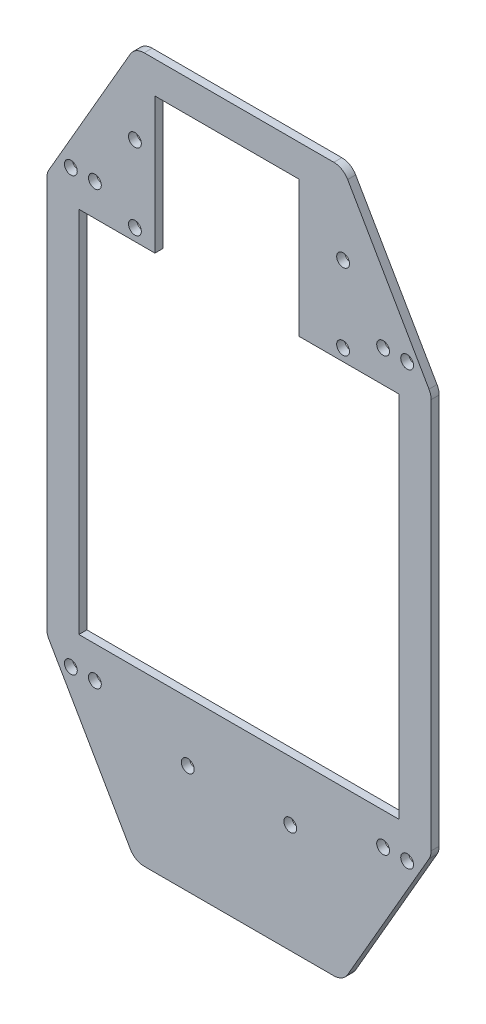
ISO-10303-21;
HEADER;
FILE_DESCRIPTION(('STEP AP214'),'2;1');
FILE_NAME('part.step','',(''),(''),'','','');
FILE_SCHEMA(('AUTOMOTIVE_DESIGN { 1 0 10303 214 1 1 1 1 }'));
ENDSEC;
DATA;
#1=APPLICATION_CONTEXT('core data for automotive mechanical design processes');
#2=APPLICATION_PROTOCOL_DEFINITION('international standard','automotive_design',2000,#1);
#3=PRODUCT_CONTEXT('',#1,'mechanical');
#4=PRODUCT('Part','Part','',(#3));
#5=PRODUCT_RELATED_PRODUCT_CATEGORY('part','',(#4));
#6=PRODUCT_DEFINITION_FORMATION('','',#4);
#7=PRODUCT_DEFINITION_CONTEXT('part definition',#1,'design');
#8=PRODUCT_DEFINITION('design','',#6,#7);
#9=PRODUCT_DEFINITION_SHAPE('','',#8);
#10=(LENGTH_UNIT() NAMED_UNIT(*) SI_UNIT(.MILLI.,.METRE.));
#11=(NAMED_UNIT(*) PLANE_ANGLE_UNIT() SI_UNIT($,.RADIAN.));
#12=(NAMED_UNIT(*) SI_UNIT($,.STERADIAN.) SOLID_ANGLE_UNIT());
#13=UNCERTAINTY_MEASURE_WITH_UNIT(LENGTH_MEASURE(1.E-05),#10,'distance_accuracy_value','');
#14=(GEOMETRIC_REPRESENTATION_CONTEXT(3) GLOBAL_UNCERTAINTY_ASSIGNED_CONTEXT((#13)) GLOBAL_UNIT_ASSIGNED_CONTEXT((#10,
#11,#12)) REPRESENTATION_CONTEXT('',''));
#15=CARTESIAN_POINT('',(0.,0.,0.));
#16=DIRECTION('',(0.,0.,1.));
#17=DIRECTION('',(1.,0.,0.));
#18=AXIS2_PLACEMENT_3D('',#15,#16,#17);
#19=CARTESIAN_POINT('',(0.,0.,4.));
#20=DIRECTION('',(0.,0.,1.));
#21=DIRECTION('',(1.,0.,0.));
#22=AXIS2_PLACEMENT_3D('',#19,#20,#21);
#23=PLANE('',#22);
#24=CARTESIAN_POINT('',(105.,135.,4.));
#25=DIRECTION('',(0.,0.,1.));
#26=DIRECTION('',(1.,0.,0.));
#27=AXIS2_PLACEMENT_3D('',#24,#25,#26);
#28=CIRCLE('',#27,4.00000000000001);
#29=CARTESIAN_POINT('',(109.,135.,4.));
#30=VERTEX_POINT('',#29);
#31=EDGE_CURVE('E1065',#30,#30,#28,.T.);
#32=ORIENTED_EDGE('',*,*,#31,.T.);
#33=EDGE_LOOP('',(#32));
#34=FACE_BOUND('',#33,.T.);
#35=CARTESIAN_POINT('',(90.,135.,4.));
#36=DIRECTION('',(0.,0.,1.));
#37=DIRECTION('',(1.,0.,0.));
#38=AXIS2_PLACEMENT_3D('',#35,#36,#37);
#39=CIRCLE('',#38,4.00000000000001);
#40=CARTESIAN_POINT('',(94.,135.,4.));
#41=VERTEX_POINT('',#40);
#42=EDGE_CURVE('E1067',#41,#41,#39,.T.);
#43=ORIENTED_EDGE('',*,*,#42,.T.);
#44=EDGE_LOOP('',(#43));
#45=FACE_BOUND('',#44,.T.);
#46=CARTESIAN_POINT('',(-105.,135.,4.));
#47=DIRECTION('',(0.,0.,1.));
#48=DIRECTION('',(1.,0.,0.));
#49=AXIS2_PLACEMENT_3D('',#46,#47,#48);
#50=CIRCLE('',#49,4.00000000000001);
#51=CARTESIAN_POINT('',(-101.,135.,4.));
#52=VERTEX_POINT('',#51);
#53=EDGE_CURVE('E1086',#52,#52,#50,.F.);
#54=ORIENTED_EDGE('',*,*,#53,.F.);
#55=EDGE_LOOP('',(#54));
#56=FACE_BOUND('',#55,.T.);
#57=CARTESIAN_POINT('',(-90.,135.,4.));
#58=DIRECTION('',(0.,0.,1.));
#59=DIRECTION('',(1.,0.,0.));
#60=AXIS2_PLACEMENT_3D('',#57,#58,#59);
#61=CIRCLE('',#60,4.00000000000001);
#62=CARTESIAN_POINT('',(-86.,135.,4.));
#63=VERTEX_POINT('',#62);
#64=EDGE_CURVE('E1081',#63,#63,#61,.F.);
#65=ORIENTED_EDGE('',*,*,#64,.F.);
#66=EDGE_LOOP('',(#65));
#67=FACE_BOUND('',#66,.T.);
#68=CARTESIAN_POINT('',(105.,-135.,4.));
#69=DIRECTION('',(0.,0.,1.));
#70=DIRECTION('',(1.,0.,0.));
#71=AXIS2_PLACEMENT_3D('',#68,#69,#70);
#72=CIRCLE('',#71,4.00000000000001);
#73=CARTESIAN_POINT('',(109.,-135.,4.));
#74=VERTEX_POINT('',#73);
#75=EDGE_CURVE('E1102',#74,#74,#72,.F.);
#76=ORIENTED_EDGE('',*,*,#75,.F.);
#77=EDGE_LOOP('',(#76));
#78=FACE_BOUND('',#77,.T.);
#79=CARTESIAN_POINT('',(90.,-135.,4.));
#80=DIRECTION('',(0.,0.,1.));
#81=DIRECTION('',(1.,0.,0.));
#82=AXIS2_PLACEMENT_3D('',#79,#80,#81);
#83=CIRCLE('',#82,4.00000000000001);
#84=CARTESIAN_POINT('',(94.,-135.,4.));
#85=VERTEX_POINT('',#84);
#86=EDGE_CURVE('E1095',#85,#85,#83,.F.);
#87=ORIENTED_EDGE('',*,*,#86,.F.);
#88=EDGE_LOOP('',(#87));
#89=FACE_BOUND('',#88,.T.);
#90=CARTESIAN_POINT('',(-105.,-135.,4.));
#91=DIRECTION('',(0.,0.,1.));
#92=DIRECTION('',(1.,0.,0.));
#93=AXIS2_PLACEMENT_3D('',#90,#91,#92);
#94=CIRCLE('',#93,4.00000000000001);
#95=CARTESIAN_POINT('',(-101.,-135.,4.));
#96=VERTEX_POINT('',#95);
#97=EDGE_CURVE('E1118',#96,#96,#94,.T.);
#98=ORIENTED_EDGE('',*,*,#97,.T.);
#99=EDGE_LOOP('',(#98));
#100=FACE_BOUND('',#99,.T.);
#101=CARTESIAN_POINT('',(-90.,-135.,4.));
#102=DIRECTION('',(0.,0.,1.));
#103=DIRECTION('',(1.,0.,0.));
#104=AXIS2_PLACEMENT_3D('',#101,#102,#103);
#105=CIRCLE('',#104,4.00000000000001);
#106=CARTESIAN_POINT('',(-86.,-135.,4.));
#107=VERTEX_POINT('',#106);
#108=EDGE_CURVE('E1111',#107,#107,#105,.T.);
#109=ORIENTED_EDGE('',*,*,#108,.T.);
#110=EDGE_LOOP('',(#109));
#111=FACE_BOUND('',#110,.T.);
#112=CARTESIAN_POINT('',(-32.,-152.,4.));
#113=DIRECTION('',(0.,0.,1.));
#114=DIRECTION('',(1.,0.,0.));
#115=AXIS2_PLACEMENT_3D('',#112,#113,#114);
#116=CIRCLE('',#115,4.00000000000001);
#117=CARTESIAN_POINT('',(-28.,-152.,4.));
#118=VERTEX_POINT('',#117);
#119=EDGE_CURVE('E1140',#118,#118,#116,.F.);
#120=ORIENTED_EDGE('',*,*,#119,.F.);
#121=EDGE_LOOP('',(#120));
#122=FACE_BOUND('',#121,.T.);
#123=CARTESIAN_POINT('',(-65.,170.,4.));
#124=DIRECTION('',(0.,0.,1.));
#125=DIRECTION('',(1.,0.,0.));
#126=AXIS2_PLACEMENT_3D('',#123,#124,#125);
#127=CIRCLE('',#126,4.00000000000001);
#128=CARTESIAN_POINT('',(-61.,170.,4.));
#129=VERTEX_POINT('',#128);
#130=EDGE_CURVE('E1137',#129,#129,#127,.F.);
#131=ORIENTED_EDGE('',*,*,#130,.F.);
#132=EDGE_LOOP('',(#131));
#133=FACE_BOUND('',#132,.T.);
#134=CARTESIAN_POINT('',(-65.,122.5,4.));
#135=DIRECTION('',(0.,0.,1.));
#136=DIRECTION('',(1.,0.,0.));
#137=AXIS2_PLACEMENT_3D('',#134,#135,#136);
#138=CIRCLE('',#137,4.00000000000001);
#139=CARTESIAN_POINT('',(-61.,122.5,4.));
#140=VERTEX_POINT('',#139);
#141=EDGE_CURVE('E1133',#140,#140,#138,.F.);
#142=ORIENTED_EDGE('',*,*,#141,.F.);
#143=EDGE_LOOP('',(#142));
#144=FACE_BOUND('',#143,.T.);
#145=CARTESIAN_POINT('',(32.,-152.,4.));
#146=DIRECTION('',(0.,0.,1.));
#147=DIRECTION('',(1.,0.,0.));
#148=AXIS2_PLACEMENT_3D('',#145,#146,#147);
#149=CIRCLE('',#148,4.00000000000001);
#150=CARTESIAN_POINT('',(36.,-152.,4.));
#151=VERTEX_POINT('',#150);
#152=EDGE_CURVE('E1164',#151,#151,#149,.T.);
#153=ORIENTED_EDGE('',*,*,#152,.T.);
#154=EDGE_LOOP('',(#153));
#155=FACE_BOUND('',#154,.T.);
#156=CARTESIAN_POINT('',(65.,170.,4.));
#157=DIRECTION('',(0.,0.,1.));
#158=DIRECTION('',(1.,0.,0.));
#159=AXIS2_PLACEMENT_3D('',#156,#157,#158);
#160=CIRCLE('',#159,4.00000000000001);
#161=CARTESIAN_POINT('',(69.,170.,4.));
#162=VERTEX_POINT('',#161);
#163=EDGE_CURVE('E1160',#162,#162,#160,.T.);
#164=ORIENTED_EDGE('',*,*,#163,.T.);
#165=EDGE_LOOP('',(#164));
#166=FACE_BOUND('',#165,.T.);
#167=CARTESIAN_POINT('',(65.,122.5,4.));
#168=DIRECTION('',(0.,0.,1.));
#169=DIRECTION('',(1.,0.,0.));
#170=AXIS2_PLACEMENT_3D('',#167,#168,#169);
#171=CIRCLE('',#170,4.00000000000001);
#172=CARTESIAN_POINT('',(69.,122.5,4.));
#173=VERTEX_POINT('',#172);
#174=EDGE_CURVE('E1156',#173,#173,#171,.T.);
#175=ORIENTED_EDGE('',*,*,#174,.T.);
#176=EDGE_LOOP('',(#175));
#177=FACE_BOUND('',#176,.T.);
#178=DIRECTION('',(0.,1.,0.));
#179=VECTOR('',#178,1.);
#180=CARTESIAN_POINT('',(99.9999999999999,116.666666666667,4.));
#181=LINE('',#180,#179);
#182=CARTESIAN_POINT('',(100.,-115.,4.));
#183=VERTEX_POINT('',#182);
#184=CARTESIAN_POINT('',(99.9999999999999,115.,4.));
#185=VERTEX_POINT('',#184);
#186=EDGE_CURVE('E1187',#183,#185,#181,.T.);
#187=ORIENTED_EDGE('',*,*,#186,.T.);
#188=DIRECTION('',(-1.,0.,0.));
#189=VECTOR('',#188,1.);
#190=CARTESIAN_POINT('',(-37.5,115.,4.));
#191=LINE('',#190,#189);
#192=CARTESIAN_POINT('',(37.5,115.,4.));
#193=VERTEX_POINT('',#192);
#194=EDGE_CURVE('E1175',#185,#193,#191,.T.);
#195=ORIENTED_EDGE('',*,*,#194,.T.);
#196=DIRECTION('',(0.,-1.,0.));
#197=VECTOR('',#196,1.);
#198=CARTESIAN_POINT('',(37.5,200.,4.));
#199=LINE('',#198,#197);
#200=CARTESIAN_POINT('',(37.5,200.,4.));
#201=VERTEX_POINT('',#200);
#202=EDGE_CURVE('E1180',#201,#193,#199,.T.);
#203=ORIENTED_EDGE('',*,*,#202,.F.);
#204=DIRECTION('',(-1.,0.,0.));
#205=VECTOR('',#204,1.);
#206=CARTESIAN_POINT('',(47.6609802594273,200.,4.));
#207=LINE('',#206,#205);
#208=CARTESIAN_POINT('',(-52.5,200.,4.));
#209=VERTEX_POINT('',#208);
#210=EDGE_CURVE('E69',#201,#209,#207,.T.);
#211=ORIENTED_EDGE('',*,*,#210,.T.);
#212=DIRECTION('',(0.,1.,0.));
#213=VECTOR('',#212,1.);
#214=CARTESIAN_POINT('',(-52.5,200.,4.));
#215=LINE('',#214,#213);
#216=CARTESIAN_POINT('',(-52.5,115.,4.));
#217=VERTEX_POINT('',#216);
#218=EDGE_CURVE('E1168',#217,#209,#215,.T.);
#219=ORIENTED_EDGE('',*,*,#218,.F.);
#220=CARTESIAN_POINT('',(-100.,115.,4.));
#221=VERTEX_POINT('',#220);
#222=EDGE_CURVE('E1171',#217,#221,#191,.T.);
#223=ORIENTED_EDGE('',*,*,#222,.T.);
#224=DIRECTION('',(0.,-1.,0.));
#225=VECTOR('',#224,1.);
#226=CARTESIAN_POINT('',(-100.,116.666666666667,4.));
#227=LINE('',#226,#225);
#228=CARTESIAN_POINT('',(-100.,-115.,4.));
#229=VERTEX_POINT('',#228);
#230=EDGE_CURVE('E1174',#221,#229,#227,.T.);
#231=ORIENTED_EDGE('',*,*,#230,.T.);
#232=DIRECTION('',(-1.,0.,0.));
#233=VECTOR('',#232,1.);
#234=CARTESIAN_POINT('',(-37.5,-115.,4.));
#235=LINE('',#234,#233);
#236=EDGE_CURVE('E1183',#183,#229,#235,.T.);
#237=ORIENTED_EDGE('',*,*,#236,.F.);
#238=EDGE_LOOP('',(#187,#195,#203,#211,#219,#223,#231,#237));
#239=FACE_BOUND('',#238,.T.);
#240=DIRECTION('',(-0.499999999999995,-0.866025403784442,0.));
#241=VECTOR('',#240,1.);
#242=CARTESIAN_POINT('',(77.1058439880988,-199.,4.));
#243=LINE('',#242,#241);
#244=CARTESIAN_POINT('',(118.660254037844,-127.025650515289,4.));
#245=VERTEX_POINT('',#244);
#246=CARTESIAN_POINT('',(67.8682396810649,-215.,4.));
#247=VERTEX_POINT('',#246);
#248=EDGE_CURVE('E258',#245,#247,#243,.T.);
#249=ORIENTED_EDGE('',*,*,#248,.T.);
#250=CARTESIAN_POINT('',(59.2079856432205,-210.,4.));
#251=DIRECTION('',(0.,0.,1.));
#252=DIRECTION('',(1.,0.,0.));
#253=AXIS2_PLACEMENT_3D('',#250,#251,#252);
#254=CIRCLE('',#253,10.);
#255=CARTESIAN_POINT('',(59.2079856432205,-220.,4.));
#256=VERTEX_POINT('',#255);
#257=EDGE_CURVE('E13',#256,#247,#254,.T.);
#258=ORIENTED_EDGE('',*,*,#257,.F.);
#259=DIRECTION('',(1.,0.,0.));
#260=VECTOR('',#259,1.);
#261=CARTESIAN_POINT('',(0.,-220.,4.));
#262=LINE('',#261,#260);
#263=CARTESIAN_POINT('',(-59.2079856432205,-220.,4.));
#264=VERTEX_POINT('',#263);
#265=EDGE_CURVE('E54',#264,#256,#262,.T.);
#266=ORIENTED_EDGE('',*,*,#265,.F.);
#267=CARTESIAN_POINT('',(-59.2079856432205,-210.,4.));
#268=DIRECTION('',(0.,0.,1.));
#269=DIRECTION('',(1.,0.,0.));
#270=AXIS2_PLACEMENT_3D('',#267,#268,#269);
#271=CIRCLE('',#270,10.);
#272=CARTESIAN_POINT('',(-67.8682396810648,-215.,4.));
#273=VERTEX_POINT('',#272);
#274=EDGE_CURVE('E237',#273,#264,#271,.T.);
#275=ORIENTED_EDGE('',*,*,#274,.F.);
#276=DIRECTION('',(-0.499999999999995,0.866025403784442,0.));
#277=VECTOR('',#276,1.);
#278=CARTESIAN_POINT('',(-77.1058439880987,-199.,4.));
#279=LINE('',#278,#277);
#280=CARTESIAN_POINT('',(-118.660254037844,-127.025650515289,4.));
#281=VERTEX_POINT('',#280);
#282=EDGE_CURVE('E387',#273,#281,#279,.T.);
#283=ORIENTED_EDGE('',*,*,#282,.T.);
#284=CARTESIAN_POINT('',(-110.,-122.025650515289,4.));
#285=DIRECTION('',(0.,0.,-1.));
#286=DIRECTION('',(-1.,0.,0.));
#287=AXIS2_PLACEMENT_3D('',#284,#285,#286);
#288=CIRCLE('',#287,9.99999999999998);
#289=CARTESIAN_POINT('',(-120.,-122.025650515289,4.));
#290=VERTEX_POINT('',#289);
#291=EDGE_CURVE('E390',#281,#290,#288,.T.);
#292=ORIENTED_EDGE('',*,*,#291,.T.);
#293=DIRECTION('',(0.,1.,0.));
#294=VECTOR('',#293,1.);
#295=CARTESIAN_POINT('',(-120.,-122.025650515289,4.));
#296=LINE('',#295,#294);
#297=CARTESIAN_POINT('',(-120.,122.025650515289,4.));
#298=VERTEX_POINT('',#297);
#299=EDGE_CURVE('E392',#290,#298,#296,.T.);
#300=ORIENTED_EDGE('',*,*,#299,.T.);
#301=CARTESIAN_POINT('',(-110.,122.025650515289,4.));
#302=DIRECTION('',(0.,0.,-1.));
#303=DIRECTION('',(-1.,0.,0.));
#304=AXIS2_PLACEMENT_3D('',#301,#302,#303);
#305=CIRCLE('',#304,10.);
#306=CARTESIAN_POINT('',(-118.660254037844,127.025650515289,4.));
#307=VERTEX_POINT('',#306);
#308=EDGE_CURVE('E380',#298,#307,#305,.T.);
#309=ORIENTED_EDGE('',*,*,#308,.T.);
#310=DIRECTION('',(0.500000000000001,0.866025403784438,0.));
#311=VECTOR('',#310,1.);
#312=CARTESIAN_POINT('',(-118.660254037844,127.025650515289,4.));
#313=LINE('',#312,#311);
#314=CARTESIAN_POINT('',(-67.8682396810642,215.,4.));
#315=VERTEX_POINT('',#314);
#316=EDGE_CURVE('E230',#307,#315,#313,.T.);
#317=ORIENTED_EDGE('',*,*,#316,.T.);
#318=CARTESIAN_POINT('',(-59.2079856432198,210.,4.));
#319=DIRECTION('',(0.,0.,1.));
#320=DIRECTION('',(1.,0.,0.));
#321=AXIS2_PLACEMENT_3D('',#318,#319,#320);
#322=CIRCLE('',#321,10.);
#323=CARTESIAN_POINT('',(-59.2079856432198,220.,4.));
#324=VERTEX_POINT('',#323);
#325=EDGE_CURVE('E214',#324,#315,#322,.T.);
#326=ORIENTED_EDGE('',*,*,#325,.F.);
#327=DIRECTION('',(-1.,0.,0.));
#328=VECTOR('',#327,1.);
#329=CARTESIAN_POINT('',(0.,220.,4.));
#330=LINE('',#329,#328);
#331=CARTESIAN_POINT('',(59.2079856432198,220.,4.));
#332=VERTEX_POINT('',#331);
#333=EDGE_CURVE('E220',#332,#324,#330,.T.);
#334=ORIENTED_EDGE('',*,*,#333,.F.);
#335=CARTESIAN_POINT('',(59.2079856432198,210.,4.));
#336=DIRECTION('',(0.,0.,1.));
#337=DIRECTION('',(1.,0.,0.));
#338=AXIS2_PLACEMENT_3D('',#335,#336,#337);
#339=CIRCLE('',#338,10.);
#340=CARTESIAN_POINT('',(67.8682396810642,215.,4.));
#341=VERTEX_POINT('',#340);
#342=EDGE_CURVE('E232',#341,#332,#339,.T.);
#343=ORIENTED_EDGE('',*,*,#342,.F.);
#344=DIRECTION('',(0.500000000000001,-0.866025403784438,0.));
#345=VECTOR('',#344,1.);
#346=CARTESIAN_POINT('',(118.660254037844,127.025650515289,4.));
#347=LINE('',#346,#345);
#348=CARTESIAN_POINT('',(118.660254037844,127.025650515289,4.));
#349=VERTEX_POINT('',#348);
#350=EDGE_CURVE('E395',#341,#349,#347,.T.);
#351=ORIENTED_EDGE('',*,*,#350,.T.);
#352=CARTESIAN_POINT('',(110.,122.025650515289,4.));
#353=DIRECTION('',(0.,0.,-1.));
#354=DIRECTION('',(1.,0.,0.));
#355=AXIS2_PLACEMENT_3D('',#352,#353,#354);
#356=CIRCLE('',#355,9.99999999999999);
#357=CARTESIAN_POINT('',(120.,122.025650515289,4.));
#358=VERTEX_POINT('',#357);
#359=EDGE_CURVE('E398',#349,#358,#356,.T.);
#360=ORIENTED_EDGE('',*,*,#359,.T.);
#361=DIRECTION('',(0.,-1.,0.));
#362=VECTOR('',#361,1.);
#363=CARTESIAN_POINT('',(120.,-122.025650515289,4.));
#364=LINE('',#363,#362);
#365=CARTESIAN_POINT('',(120.,-122.025650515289,4.));
#366=VERTEX_POINT('',#365);
#367=EDGE_CURVE('E401',#358,#366,#364,.T.);
#368=ORIENTED_EDGE('',*,*,#367,.T.);
#369=CARTESIAN_POINT('',(110.,-122.025650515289,4.));
#370=DIRECTION('',(0.,0.,-1.));
#371=DIRECTION('',(1.,0.,0.));
#372=AXIS2_PLACEMENT_3D('',#369,#370,#371);
#373=CIRCLE('',#372,9.99999999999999);
#374=EDGE_CURVE('E403',#366,#245,#373,.T.);
#375=ORIENTED_EDGE('',*,*,#374,.T.);
#376=EDGE_LOOP('',(#249,#258,#266,#275,#283,#292,#300,#309,#317,#326,#334,#343,#351,#360,#368,#375));
#377=FACE_BOUND('',#376,.T.);
#378=ADVANCED_FACE('F45',(#34,#45,#56,#67,#78,#89,#100,#111,#122,#133,#144,#155,#166,#177,#239,
#377),#23,.F.);
#379=CARTESIAN_POINT('',(-37.5,115.,-10.));
#380=DIRECTION('',(0.,-1.,0.));
#381=DIRECTION('',(0.,0.,-1.));
#382=AXIS2_PLACEMENT_3D('',#379,#380,#381);
#383=PLANE('',#382);
#384=ORIENTED_EDGE('',*,*,#194,.F.);
#385=DIRECTION('',(0.,0.,1.));
#386=VECTOR('',#385,1.);
#387=CARTESIAN_POINT('',(100.,115.,-10.));
#388=LINE('',#387,#386);
#389=CARTESIAN_POINT('',(99.9999999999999,115.,9.));
#390=VERTEX_POINT('',#389);
#391=EDGE_CURVE('E410',#185,#390,#388,.T.);
#392=ORIENTED_EDGE('',*,*,#391,.T.);
#393=DIRECTION('',(-1.,0.,0.));
#394=VECTOR('',#393,1.);
#395=CARTESIAN_POINT('',(-37.5,115.,9.));
#396=LINE('',#395,#394);
#397=CARTESIAN_POINT('',(37.5,115.,9.));
#398=VERTEX_POINT('',#397);
#399=EDGE_CURVE('E323',#390,#398,#396,.T.);
#400=ORIENTED_EDGE('',*,*,#399,.T.);
#401=DIRECTION('',(0.,0.,1.));
#402=VECTOR('',#401,1.);
#403=CARTESIAN_POINT('',(37.5,115.,-10.));
#404=LINE('',#403,#402);
#405=EDGE_CURVE('E316',#193,#398,#404,.T.);
#406=ORIENTED_EDGE('',*,*,#405,.F.);
#407=EDGE_LOOP('',(#384,#392,#400,#406));
#408=FACE_BOUND('',#407,.T.);
#409=ADVANCED_FACE('F510',(#408),#383,.T.);
#410=CARTESIAN_POINT('',(-118.660254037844,127.025650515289,30.));
#411=DIRECTION('',(0.866025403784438,-0.500000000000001,0.));
#412=DIRECTION('',(0.500000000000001,0.866025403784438,0.));
#413=AXIS2_PLACEMENT_3D('',#410,#411,#412);
#414=PLANE('',#413);
#415=DIRECTION('',(0.,0.,-1.));
#416=VECTOR('',#415,1.);
#417=CARTESIAN_POINT('',(-67.8682396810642,215.,30.));
#418=LINE('',#417,#416);
#419=CARTESIAN_POINT('',(-67.8682396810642,215.,9.));
#420=VERTEX_POINT('',#419);
#421=EDGE_CURVE('E217',#420,#315,#418,.T.);
#422=ORIENTED_EDGE('',*,*,#421,.T.);
#423=ORIENTED_EDGE('',*,*,#316,.F.);
#424=DIRECTION('',(0.,0.,-1.));
#425=VECTOR('',#424,1.);
#426=CARTESIAN_POINT('',(-118.660254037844,127.025650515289,30.));
#427=LINE('',#426,#425);
#428=CARTESIAN_POINT('',(-118.660254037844,127.025650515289,9.));
#429=VERTEX_POINT('',#428);
#430=EDGE_CURVE('E426',#429,#307,#427,.T.);
#431=ORIENTED_EDGE('',*,*,#430,.F.);
#432=DIRECTION('',(-0.500000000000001,-0.866025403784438,0.));
#433=VECTOR('',#432,1.);
#434=CARTESIAN_POINT('',(-118.660254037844,127.025650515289,9.));
#435=LINE('',#434,#433);
#436=EDGE_CURVE('E369',#420,#429,#435,.T.);
#437=ORIENTED_EDGE('',*,*,#436,.F.);
#438=EDGE_LOOP('',(#422,#423,#431,#437));
#439=FACE_BOUND('',#438,.T.);
#440=ADVANCED_FACE('F483',(#439),#414,.F.);
#441=CARTESIAN_POINT('',(-110.,-122.025650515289,30.));
#442=DIRECTION('',(0.,0.,-1.));
#443=DIRECTION('',(-1.,0.,0.));
#444=AXIS2_PLACEMENT_3D('',#441,#442,#443);
#445=CYLINDRICAL_SURFACE('',#444,9.99999999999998);
#446=CARTESIAN_POINT('',(-110.,-122.025650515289,9.));
#447=DIRECTION('',(0.,0.,1.));
#448=DIRECTION('',(1.,0.,0.));
#449=AXIS2_PLACEMENT_3D('',#446,#447,#448);
#450=CIRCLE('',#449,9.99999999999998);
#451=CARTESIAN_POINT('',(-120.,-122.025650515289,9.));
#452=VERTEX_POINT('',#451);
#453=CARTESIAN_POINT('',(-118.660254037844,-127.025650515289,9.));
#454=VERTEX_POINT('',#453);
#455=EDGE_CURVE('E357',#452,#454,#450,.T.);
#456=ORIENTED_EDGE('',*,*,#455,.F.);
#457=DIRECTION('',(0.,0.,-1.));
#458=VECTOR('',#457,1.);
#459=CARTESIAN_POINT('',(-120.,-122.025650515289,30.));
#460=LINE('',#459,#458);
#461=EDGE_CURVE('E418',#452,#290,#460,.T.);
#462=ORIENTED_EDGE('',*,*,#461,.T.);
#463=ORIENTED_EDGE('',*,*,#291,.F.);
#464=DIRECTION('',(0.,0.,-1.));
#465=VECTOR('',#464,1.);
#466=CARTESIAN_POINT('',(-118.660254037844,-127.025650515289,30.));
#467=LINE('',#466,#465);
#468=EDGE_CURVE('E279',#454,#281,#467,.T.);
#469=ORIENTED_EDGE('',*,*,#468,.F.);
#470=EDGE_LOOP('',(#456,#462,#463,#469));
#471=FACE_BOUND('',#470,.T.);
#472=ADVANCED_FACE('F47',(#471),#445,.T.);
#473=CARTESIAN_POINT('',(-118.660254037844,-127.025650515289,30.));
#474=DIRECTION('',(0.866025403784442,0.499999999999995,0.));
#475=DIRECTION('',(-0.499999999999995,0.866025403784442,0.));
#476=AXIS2_PLACEMENT_3D('',#473,#474,#475);
#477=PLANE('',#476);
#478=ORIENTED_EDGE('',*,*,#282,.F.);
#479=DIRECTION('',(0.,0.,-1.));
#480=VECTOR('',#479,1.);
#481=CARTESIAN_POINT('',(-67.8682396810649,-215.,30.));
#482=LINE('',#481,#480);
#483=CARTESIAN_POINT('',(-67.8682396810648,-215.,9.));
#484=VERTEX_POINT('',#483);
#485=EDGE_CURVE('E270',#484,#273,#482,.T.);
#486=ORIENTED_EDGE('',*,*,#485,.F.);
#487=DIRECTION('',(0.499999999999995,-0.866025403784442,0.));
#488=VECTOR('',#487,1.);
#489=CARTESIAN_POINT('',(-118.660254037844,-127.025650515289,9.));
#490=LINE('',#489,#488);
#491=EDGE_CURVE('E354',#454,#484,#490,.T.);
#492=ORIENTED_EDGE('',*,*,#491,.F.);
#493=ORIENTED_EDGE('',*,*,#468,.T.);
#494=EDGE_LOOP('',(#478,#486,#492,#493));
#495=FACE_BOUND('',#494,.T.);
#496=ADVANCED_FACE('F467',(#495),#477,.F.);
#497=CARTESIAN_POINT('',(-110.,122.025650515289,30.));
#498=DIRECTION('',(0.,0.,-1.));
#499=DIRECTION('',(-1.,0.,0.));
#500=AXIS2_PLACEMENT_3D('',#497,#498,#499);
#501=CYLINDRICAL_SURFACE('',#500,10.);
#502=CARTESIAN_POINT('',(-110.,122.025650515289,9.));
#503=DIRECTION('',(0.,0.,1.));
#504=DIRECTION('',(1.,0.,0.));
#505=AXIS2_PLACEMENT_3D('',#502,#503,#504);
#506=CIRCLE('',#505,10.);
#507=CARTESIAN_POINT('',(-120.,122.025650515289,9.));
#508=VERTEX_POINT('',#507);
#509=EDGE_CURVE('E366',#429,#508,#506,.T.);
#510=ORIENTED_EDGE('',*,*,#509,.F.);
#511=ORIENTED_EDGE('',*,*,#430,.T.);
#512=ORIENTED_EDGE('',*,*,#308,.F.);
#513=DIRECTION('',(0.,0.,-1.));
#514=VECTOR('',#513,1.);
#515=CARTESIAN_POINT('',(-120.,122.025650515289,30.));
#516=LINE('',#515,#514);
#517=EDGE_CURVE('E422',#508,#298,#516,.T.);
#518=ORIENTED_EDGE('',*,*,#517,.F.);
#519=EDGE_LOOP('',(#510,#511,#512,#518));
#520=FACE_BOUND('',#519,.T.);
#521=ADVANCED_FACE('F480',(#520),#501,.T.);
#522=CARTESIAN_POINT('',(-120.,122.025650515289,30.));
#523=DIRECTION('',(1.,0.,0.));
#524=DIRECTION('',(0.,1.,0.));
#525=AXIS2_PLACEMENT_3D('',#522,#523,#524);
#526=PLANE('',#525);
#527=DIRECTION('',(0.,-1.,0.));
#528=VECTOR('',#527,1.);
#529=CARTESIAN_POINT('',(-120.,122.025650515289,9.));
#530=LINE('',#529,#528);
#531=EDGE_CURVE('E363',#508,#452,#530,.T.);
#532=ORIENTED_EDGE('',*,*,#531,.F.);
#533=ORIENTED_EDGE('',*,*,#517,.T.);
#534=ORIENTED_EDGE('',*,*,#299,.F.);
#535=ORIENTED_EDGE('',*,*,#461,.F.);
#536=EDGE_LOOP('',(#532,#533,#534,#535));
#537=FACE_BOUND('',#536,.T.);
#538=ADVANCED_FACE('F474',(#537),#526,.F.);
#539=CARTESIAN_POINT('',(-59.2079856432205,-210.,30.));
#540=DIRECTION('',(0.,0.,-1.));
#541=DIRECTION('',(-1.,0.,0.));
#542=AXIS2_PLACEMENT_3D('',#539,#540,#541);
#543=CYLINDRICAL_SURFACE('',#542,10.);
#544=CARTESIAN_POINT('',(-59.2079856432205,-210.,9.));
#545=DIRECTION('',(0.,0.,1.));
#546=DIRECTION('',(1.,0.,0.));
#547=AXIS2_PLACEMENT_3D('',#544,#545,#546);
#548=CIRCLE('',#547,10.);
#549=CARTESIAN_POINT('',(-59.2079856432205,-220.,9.));
#550=VERTEX_POINT('',#549);
#551=EDGE_CURVE('E351',#484,#550,#548,.T.);
#552=ORIENTED_EDGE('',*,*,#551,.F.);
#553=ORIENTED_EDGE('',*,*,#485,.T.);
#554=ORIENTED_EDGE('',*,*,#274,.T.);
#555=DIRECTION('',(0.,0.,-1.));
#556=VECTOR('',#555,1.);
#557=CARTESIAN_POINT('',(-59.2079856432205,-220.,30.));
#558=LINE('',#557,#556);
#559=EDGE_CURVE('E255',#550,#264,#558,.T.);
#560=ORIENTED_EDGE('',*,*,#559,.F.);
#561=EDGE_LOOP('',(#552,#553,#554,#560));
#562=FACE_BOUND('',#561,.T.);
#563=ADVANCED_FACE('F460',(#562),#543,.T.);
#564=CARTESIAN_POINT('',(59.2079856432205,-220.,30.));
#565=DIRECTION('',(0.,1.,0.));
#566=DIRECTION('',(0.,0.,1.));
#567=AXIS2_PLACEMENT_3D('',#564,#565,#566);
#568=PLANE('',#567);
#569=DIRECTION('',(1.,0.,0.));
#570=VECTOR('',#569,1.);
#571=CARTESIAN_POINT('',(59.2079856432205,-220.,9.));
#572=LINE('',#571,#570);
#573=CARTESIAN_POINT('',(59.2079856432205,-220.,9.));
#574=VERTEX_POINT('',#573);
#575=EDGE_CURVE('E348',#550,#574,#572,.T.);
#576=ORIENTED_EDGE('',*,*,#575,.F.);
#577=ORIENTED_EDGE('',*,*,#559,.T.);
#578=ORIENTED_EDGE('',*,*,#265,.T.);
#579=DIRECTION('',(0.,0.,-1.));
#580=VECTOR('',#579,1.);
#581=CARTESIAN_POINT('',(59.2079856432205,-220.,30.));
#582=LINE('',#581,#580);
#583=EDGE_CURVE('E253',#574,#256,#582,.T.);
#584=ORIENTED_EDGE('',*,*,#583,.F.);
#585=EDGE_LOOP('',(#576,#577,#578,#584));
#586=FACE_BOUND('',#585,.T.);
#587=ADVANCED_FACE('F252',(#586),#568,.F.);
#588=CARTESIAN_POINT('',(59.2079856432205,-210.,30.));
#589=DIRECTION('',(0.,0.,-1.));
#590=DIRECTION('',(-1.,0.,0.));
#591=AXIS2_PLACEMENT_3D('',#588,#589,#590);
#592=CYLINDRICAL_SURFACE('',#591,10.);
#593=CARTESIAN_POINT('',(59.2079856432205,-210.,9.));
#594=DIRECTION('',(0.,0.,1.));
#595=DIRECTION('',(1.,0.,0.));
#596=AXIS2_PLACEMENT_3D('',#593,#594,#595);
#597=CIRCLE('',#596,10.);
#598=CARTESIAN_POINT('',(67.8682396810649,-215.,9.));
#599=VERTEX_POINT('',#598);
#600=EDGE_CURVE('E264',#574,#599,#597,.T.);
#601=ORIENTED_EDGE('',*,*,#600,.F.);
#602=ORIENTED_EDGE('',*,*,#583,.T.);
#603=ORIENTED_EDGE('',*,*,#257,.T.);
#604=DIRECTION('',(0.,0.,-1.));
#605=VECTOR('',#604,1.);
#606=CARTESIAN_POINT('',(67.8682396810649,-215.,30.));
#607=LINE('',#606,#605);
#608=EDGE_CURVE('E263',#599,#247,#607,.T.);
#609=ORIENTED_EDGE('',*,*,#608,.F.);
#610=EDGE_LOOP('',(#601,#602,#603,#609));
#611=FACE_BOUND('',#610,.T.);
#612=ADVANCED_FACE('F262',(#611),#592,.T.);
#613=CARTESIAN_POINT('',(37.5,200.,-10.));
#614=DIRECTION('',(1.,0.,0.));
#615=DIRECTION('',(0.,1.,0.));
#616=AXIS2_PLACEMENT_3D('',#613,#614,#615);
#617=PLANE('',#616);
#618=DIRECTION('',(0.,0.,1.));
#619=VECTOR('',#618,1.);
#620=CARTESIAN_POINT('',(37.5,200.,30.));
#621=LINE('',#620,#619);
#622=CARTESIAN_POINT('',(37.5,200.,9.));
#623=VERTEX_POINT('',#622);
#624=EDGE_CURVE('E225',#201,#623,#621,.T.);
#625=ORIENTED_EDGE('',*,*,#624,.F.);
#626=ORIENTED_EDGE('',*,*,#202,.T.);
#627=ORIENTED_EDGE('',*,*,#405,.T.);
#628=DIRECTION('',(0.,-1.,0.));
#629=VECTOR('',#628,1.);
#630=CARTESIAN_POINT('',(37.5,200.,9.));
#631=LINE('',#630,#629);
#632=EDGE_CURVE('E306',#623,#398,#631,.T.);
#633=ORIENTED_EDGE('',*,*,#632,.F.);
#634=EDGE_LOOP('',(#625,#626,#627,#633));
#635=FACE_BOUND('',#634,.T.);
#636=ADVANCED_FACE('F314',(#635),#617,.F.);
#637=CARTESIAN_POINT('',(47.6609802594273,200.,30.));
#638=DIRECTION('',(0.,-1.,0.));
#639=DIRECTION('',(0.,0.,-1.));
#640=AXIS2_PLACEMENT_3D('',#637,#638,#639);
#641=PLANE('',#640);
#642=ORIENTED_EDGE('',*,*,#210,.F.);
#643=ORIENTED_EDGE('',*,*,#624,.T.);
#644=DIRECTION('',(-1.,0.,0.));
#645=VECTOR('',#644,1.);
#646=CARTESIAN_POINT('',(47.6609802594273,200.,9.));
#647=LINE('',#646,#645);
#648=CARTESIAN_POINT('',(-52.5,200.,8.99999999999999));
#649=VERTEX_POINT('',#648);
#650=EDGE_CURVE('E295',#623,#649,#647,.T.);
#651=ORIENTED_EDGE('',*,*,#650,.T.);
#652=DIRECTION('',(0.,0.,1.));
#653=VECTOR('',#652,1.);
#654=CARTESIAN_POINT('',(-52.5,200.,-86.3133825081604));
#655=LINE('',#654,#653);
#656=EDGE_CURVE('E376',#209,#649,#655,.T.);
#657=ORIENTED_EDGE('',*,*,#656,.F.);
#658=EDGE_LOOP('',(#642,#643,#651,#657));
#659=FACE_BOUND('',#658,.T.);
#660=ADVANCED_FACE('F293',(#659),#641,.T.);
#661=CARTESIAN_POINT('',(118.660254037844,127.025650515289,30.));
#662=DIRECTION('',(-0.866025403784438,-0.500000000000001,0.));
#663=DIRECTION('',(0.500000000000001,-0.866025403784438,0.));
#664=AXIS2_PLACEMENT_3D('',#661,#662,#663);
#665=PLANE('',#664);
#666=ORIENTED_EDGE('',*,*,#350,.F.);
#667=DIRECTION('',(0.,0.,-1.));
#668=VECTOR('',#667,1.);
#669=CARTESIAN_POINT('',(67.8682396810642,215.,30.));
#670=LINE('',#669,#668);
#671=CARTESIAN_POINT('',(67.8682396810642,215.,9.));
#672=VERTEX_POINT('',#671);
#673=EDGE_CURVE('E433',#672,#341,#670,.T.);
#674=ORIENTED_EDGE('',*,*,#673,.F.);
#675=DIRECTION('',(-0.500000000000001,0.866025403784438,0.));
#676=VECTOR('',#675,1.);
#677=CARTESIAN_POINT('',(118.660254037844,127.025650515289,9.));
#678=LINE('',#677,#676);
#679=CARTESIAN_POINT('',(118.660254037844,127.025650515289,9.));
#680=VERTEX_POINT('',#679);
#681=EDGE_CURVE('E343',#680,#672,#678,.T.);
#682=ORIENTED_EDGE('',*,*,#681,.F.);
#683=DIRECTION('',(0.,0.,-1.));
#684=VECTOR('',#683,1.);
#685=CARTESIAN_POINT('',(118.660254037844,127.025650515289,30.));
#686=LINE('',#685,#684);
#687=EDGE_CURVE('E435',#680,#349,#686,.T.);
#688=ORIENTED_EDGE('',*,*,#687,.T.);
#689=EDGE_LOOP('',(#666,#674,#682,#688));
#690=FACE_BOUND('',#689,.T.);
#691=ADVANCED_FACE('F493',(#690),#665,.F.);
#692=CARTESIAN_POINT('',(59.2079856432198,210.,30.));
#693=DIRECTION('',(0.,0.,-1.));
#694=DIRECTION('',(-1.,0.,0.));
#695=AXIS2_PLACEMENT_3D('',#692,#693,#694);
#696=CYLINDRICAL_SURFACE('',#695,10.);
#697=CARTESIAN_POINT('',(59.2079856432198,210.,9.));
#698=DIRECTION('',(0.,0.,1.));
#699=DIRECTION('',(1.,0.,0.));
#700=AXIS2_PLACEMENT_3D('',#697,#698,#699);
#701=CIRCLE('',#700,10.);
#702=CARTESIAN_POINT('',(59.2079856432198,220.,9.));
#703=VERTEX_POINT('',#702);
#704=EDGE_CURVE('E360',#672,#703,#701,.T.);
#705=ORIENTED_EDGE('',*,*,#704,.F.);
#706=ORIENTED_EDGE('',*,*,#673,.T.);
#707=ORIENTED_EDGE('',*,*,#342,.T.);
#708=DIRECTION('',(0.,0.,-1.));
#709=VECTOR('',#708,1.);
#710=CARTESIAN_POINT('',(59.2079856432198,220.,30.));
#711=LINE('',#710,#709);
#712=EDGE_CURVE('E61',#703,#332,#711,.T.);
#713=ORIENTED_EDGE('',*,*,#712,.F.);
#714=EDGE_LOOP('',(#705,#706,#707,#713));
#715=FACE_BOUND('',#714,.T.);
#716=ADVANCED_FACE('F486',(#715),#696,.T.);
#717=CARTESIAN_POINT('',(59.2079856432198,220.,30.));
#718=DIRECTION('',(0.,-1.,0.));
#719=DIRECTION('',(0.,0.,-1.));
#720=AXIS2_PLACEMENT_3D('',#717,#718,#719);
#721=PLANE('',#720);
#722=DIRECTION('',(-1.,0.,0.));
#723=VECTOR('',#722,1.);
#724=CARTESIAN_POINT('',(59.2079856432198,220.,9.));
#725=LINE('',#724,#723);
#726=CARTESIAN_POINT('',(-59.2079856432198,220.,9.));
#727=VERTEX_POINT('',#726);
#728=EDGE_CURVE('E374',#703,#727,#725,.T.);
#729=ORIENTED_EDGE('',*,*,#728,.F.);
#730=ORIENTED_EDGE('',*,*,#712,.T.);
#731=ORIENTED_EDGE('',*,*,#333,.T.);
#732=DIRECTION('',(0.,0.,-1.));
#733=VECTOR('',#732,1.);
#734=CARTESIAN_POINT('',(-59.2079856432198,220.,30.));
#735=LINE('',#734,#733);
#736=EDGE_CURVE('E210',#727,#324,#735,.T.);
#737=ORIENTED_EDGE('',*,*,#736,.F.);
#738=EDGE_LOOP('',(#729,#730,#731,#737));
#739=FACE_BOUND('',#738,.T.);
#740=ADVANCED_FACE('F221',(#739),#721,.F.);
#741=CARTESIAN_POINT('',(-59.2079856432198,210.,30.));
#742=DIRECTION('',(0.,0.,-1.));
#743=DIRECTION('',(-1.,0.,0.));
#744=AXIS2_PLACEMENT_3D('',#741,#742,#743);
#745=CYLINDRICAL_SURFACE('',#744,10.);
#746=CARTESIAN_POINT('',(-59.2079856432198,210.,9.));
#747=DIRECTION('',(0.,0.,1.));
#748=DIRECTION('',(1.,0.,0.));
#749=AXIS2_PLACEMENT_3D('',#746,#747,#748);
#750=CIRCLE('',#749,10.);
#751=EDGE_CURVE('E215',#727,#420,#750,.T.);
#752=ORIENTED_EDGE('',*,*,#751,.F.);
#753=ORIENTED_EDGE('',*,*,#736,.T.);
#754=ORIENTED_EDGE('',*,*,#325,.T.);
#755=ORIENTED_EDGE('',*,*,#421,.F.);
#756=EDGE_LOOP('',(#752,#753,#754,#755));
#757=FACE_BOUND('',#756,.T.);
#758=ADVANCED_FACE('F211',(#757),#745,.T.);
#759=CARTESIAN_POINT('',(99.9999999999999,116.666666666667,30.));
#760=DIRECTION('',(-1.,0.,0.));
#761=DIRECTION('',(0.,-1.,0.));
#762=AXIS2_PLACEMENT_3D('',#759,#760,#761);
#763=PLANE('',#762);
#764=ORIENTED_EDGE('',*,*,#186,.F.);
#765=DIRECTION('',(0.,0.,1.));
#766=VECTOR('',#765,1.);
#767=CARTESIAN_POINT('',(100.,-115.,-10.));
#768=LINE('',#767,#766);
#769=CARTESIAN_POINT('',(100.,-115.,9.));
#770=VERTEX_POINT('',#769);
#771=EDGE_CURVE('E407',#183,#770,#768,.T.);
#772=ORIENTED_EDGE('',*,*,#771,.T.);
#773=DIRECTION('',(0.,1.,0.));
#774=VECTOR('',#773,1.);
#775=CARTESIAN_POINT('',(99.9999999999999,116.666666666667,9.));
#776=LINE('',#775,#774);
#777=EDGE_CURVE('E327',#770,#390,#776,.T.);
#778=ORIENTED_EDGE('',*,*,#777,.T.);
#779=ORIENTED_EDGE('',*,*,#391,.F.);
#780=EDGE_LOOP('',(#764,#772,#778,#779));
#781=FACE_BOUND('',#780,.T.);
#782=ADVANCED_FACE('F541',(#781),#763,.T.);
#783=CARTESIAN_POINT('',(-100.,116.666666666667,30.));
#784=DIRECTION('',(1.,0.,0.));
#785=DIRECTION('',(0.,1.,0.));
#786=AXIS2_PLACEMENT_3D('',#783,#784,#785);
#787=PLANE('',#786);
#788=ORIENTED_EDGE('',*,*,#230,.F.);
#789=DIRECTION('',(0.,0.,-1.));
#790=VECTOR('',#789,1.);
#791=CARTESIAN_POINT('',(-100.,115.,30.));
#792=LINE('',#791,#790);
#793=CARTESIAN_POINT('',(-100.,115.,9.));
#794=VERTEX_POINT('',#793);
#795=EDGE_CURVE('E283',#794,#221,#792,.T.);
#796=ORIENTED_EDGE('',*,*,#795,.F.);
#797=DIRECTION('',(0.,-1.,0.));
#798=VECTOR('',#797,1.);
#799=CARTESIAN_POINT('',(-100.,116.666666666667,9.));
#800=LINE('',#799,#798);
#801=CARTESIAN_POINT('',(-100.,-115.,9.));
#802=VERTEX_POINT('',#801);
#803=EDGE_CURVE('E312',#794,#802,#800,.T.);
#804=ORIENTED_EDGE('',*,*,#803,.T.);
#805=DIRECTION('',(0.,0.,1.));
#806=VECTOR('',#805,1.);
#807=CARTESIAN_POINT('',(-100.,-115.,-10.));
#808=LINE('',#807,#806);
#809=EDGE_CURVE('E413',#229,#802,#808,.T.);
#810=ORIENTED_EDGE('',*,*,#809,.F.);
#811=EDGE_LOOP('',(#788,#796,#804,#810));
#812=FACE_BOUND('',#811,.T.);
#813=ADVANCED_FACE('F538',(#812),#787,.T.);
#814=CARTESIAN_POINT('',(118.660254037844,-127.025650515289,30.));
#815=DIRECTION('',(-0.866025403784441,0.499999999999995,0.));
#816=DIRECTION('',(-0.499999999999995,-0.866025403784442,0.));
#817=AXIS2_PLACEMENT_3D('',#814,#815,#816);
#818=PLANE('',#817);
#819=ORIENTED_EDGE('',*,*,#608,.T.);
#820=ORIENTED_EDGE('',*,*,#248,.F.);
#821=DIRECTION('',(0.,0.,-1.));
#822=VECTOR('',#821,1.);
#823=CARTESIAN_POINT('',(118.660254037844,-127.025650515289,30.));
#824=LINE('',#823,#822);
#825=CARTESIAN_POINT('',(118.660254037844,-127.025650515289,9.));
#826=VERTEX_POINT('',#825);
#827=EDGE_CURVE('E273',#826,#245,#824,.T.);
#828=ORIENTED_EDGE('',*,*,#827,.F.);
#829=DIRECTION('',(0.499999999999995,0.866025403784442,0.));
#830=VECTOR('',#829,1.);
#831=CARTESIAN_POINT('',(118.660254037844,-127.025650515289,9.));
#832=LINE('',#831,#830);
#833=EDGE_CURVE('E340',#599,#826,#832,.T.);
#834=ORIENTED_EDGE('',*,*,#833,.F.);
#835=EDGE_LOOP('',(#819,#820,#828,#834));
#836=FACE_BOUND('',#835,.T.);
#837=ADVANCED_FACE('F456',(#836),#818,.F.);
#838=CARTESIAN_POINT('',(110.,-122.025650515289,30.));
#839=DIRECTION('',(0.,0.,-1.));
#840=DIRECTION('',(-1.,0.,0.));
#841=AXIS2_PLACEMENT_3D('',#838,#839,#840);
#842=CYLINDRICAL_SURFACE('',#841,9.99999999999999);
#843=CARTESIAN_POINT('',(110.,-122.025650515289,9.));
#844=DIRECTION('',(0.,0.,1.));
#845=DIRECTION('',(1.,0.,0.));
#846=AXIS2_PLACEMENT_3D('',#843,#844,#845);
#847=CIRCLE('',#846,9.99999999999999);
#848=CARTESIAN_POINT('',(120.,-122.025650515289,9.));
#849=VERTEX_POINT('',#848);
#850=EDGE_CURVE('E337',#826,#849,#847,.T.);
#851=ORIENTED_EDGE('',*,*,#850,.F.);
#852=ORIENTED_EDGE('',*,*,#827,.T.);
#853=ORIENTED_EDGE('',*,*,#374,.F.);
#854=DIRECTION('',(0.,0.,-1.));
#855=VECTOR('',#854,1.);
#856=CARTESIAN_POINT('',(120.,-122.025650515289,30.));
#857=LINE('',#856,#855);
#858=EDGE_CURVE('E442',#849,#366,#857,.T.);
#859=ORIENTED_EDGE('',*,*,#858,.F.);
#860=EDGE_LOOP('',(#851,#852,#853,#859));
#861=FACE_BOUND('',#860,.T.);
#862=ADVANCED_FACE('F452',(#861),#842,.T.);
#863=CARTESIAN_POINT('',(120.,122.025650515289,30.));
#864=DIRECTION('',(-1.,0.,0.));
#865=DIRECTION('',(0.,-1.,0.));
#866=AXIS2_PLACEMENT_3D('',#863,#864,#865);
#867=PLANE('',#866);
#868=DIRECTION('',(0.,1.,0.));
#869=VECTOR('',#868,1.);
#870=CARTESIAN_POINT('',(120.,122.025650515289,9.));
#871=LINE('',#870,#869);
#872=CARTESIAN_POINT('',(120.,122.025650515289,9.));
#873=VERTEX_POINT('',#872);
#874=EDGE_CURVE('E334',#849,#873,#871,.T.);
#875=ORIENTED_EDGE('',*,*,#874,.F.);
#876=ORIENTED_EDGE('',*,*,#858,.T.);
#877=ORIENTED_EDGE('',*,*,#367,.F.);
#878=DIRECTION('',(0.,0.,-1.));
#879=VECTOR('',#878,1.);
#880=CARTESIAN_POINT('',(120.,122.025650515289,30.));
#881=LINE('',#880,#879);
#882=EDGE_CURVE('E439',#873,#358,#881,.T.);
#883=ORIENTED_EDGE('',*,*,#882,.F.);
#884=EDGE_LOOP('',(#875,#876,#877,#883));
#885=FACE_BOUND('',#884,.T.);
#886=ADVANCED_FACE('F500',(#885),#867,.F.);
#887=CARTESIAN_POINT('',(110.,122.025650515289,30.));
#888=DIRECTION('',(0.,0.,-1.));
#889=DIRECTION('',(-1.,0.,0.));
#890=AXIS2_PLACEMENT_3D('',#887,#888,#889);
#891=CYLINDRICAL_SURFACE('',#890,10.);
#892=CARTESIAN_POINT('',(110.,122.025650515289,9.));
#893=DIRECTION('',(0.,0.,1.));
#894=DIRECTION('',(1.,0.,0.));
#895=AXIS2_PLACEMENT_3D('',#892,#893,#894);
#896=CIRCLE('',#895,10.);
#897=EDGE_CURVE('E331',#873,#680,#896,.T.);
#898=ORIENTED_EDGE('',*,*,#897,.F.);
#899=ORIENTED_EDGE('',*,*,#882,.T.);
#900=ORIENTED_EDGE('',*,*,#359,.F.);
#901=ORIENTED_EDGE('',*,*,#687,.F.);
#902=EDGE_LOOP('',(#898,#899,#900,#901));
#903=FACE_BOUND('',#902,.T.);
#904=ADVANCED_FACE('F496',(#903),#891,.T.);
#905=ORIENTED_EDGE('',*,*,#222,.F.);
#906=DIRECTION('',(0.,0.,1.));
#907=VECTOR('',#906,1.);
#908=CARTESIAN_POINT('',(-52.5,115.,-86.3133825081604));
#909=LINE('',#908,#907);
#910=CARTESIAN_POINT('',(-52.5,115.,8.99999999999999));
#911=VERTEX_POINT('',#910);
#912=EDGE_CURVE('E377',#217,#911,#909,.T.);
#913=ORIENTED_EDGE('',*,*,#912,.T.);
#914=EDGE_CURVE('E1191',#911,#794,#396,.T.);
#915=ORIENTED_EDGE('',*,*,#914,.T.);
#916=ORIENTED_EDGE('',*,*,#795,.T.);
#917=EDGE_LOOP('',(#905,#913,#915,#916));
#918=FACE_BOUND('',#917,.T.);
#919=ADVANCED_FACE('F506',(#918),#383,.T.);
#920=CARTESIAN_POINT('',(-37.5,-115.,-10.));
#921=DIRECTION('',(0.,-1.,0.));
#922=DIRECTION('',(0.,0.,-1.));
#923=AXIS2_PLACEMENT_3D('',#920,#921,#922);
#924=PLANE('',#923);
#925=ORIENTED_EDGE('',*,*,#771,.F.);
#926=ORIENTED_EDGE('',*,*,#236,.T.);
#927=ORIENTED_EDGE('',*,*,#809,.T.);
#928=DIRECTION('',(-1.,0.,0.));
#929=VECTOR('',#928,1.);
#930=CARTESIAN_POINT('',(-37.5,-115.,9.));
#931=LINE('',#930,#929);
#932=EDGE_CURVE('E318',#770,#802,#931,.T.);
#933=ORIENTED_EDGE('',*,*,#932,.F.);
#934=EDGE_LOOP('',(#925,#926,#927,#933));
#935=FACE_BOUND('',#934,.T.);
#936=ADVANCED_FACE('F529',(#935),#924,.F.);
#937=CARTESIAN_POINT('',(-52.5,200.,-86.3133825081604));
#938=DIRECTION('',(-1.,0.,0.));
#939=DIRECTION('',(0.,-1.,0.));
#940=AXIS2_PLACEMENT_3D('',#937,#938,#939);
#941=PLANE('',#940);
#942=ORIENTED_EDGE('',*,*,#912,.F.);
#943=ORIENTED_EDGE('',*,*,#218,.T.);
#944=ORIENTED_EDGE('',*,*,#656,.T.);
#945=DIRECTION('',(0.,1.,0.));
#946=VECTOR('',#945,1.);
#947=CARTESIAN_POINT('',(-52.5,200.,8.99999999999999));
#948=LINE('',#947,#946);
#949=EDGE_CURVE('E310',#911,#649,#948,.T.);
#950=ORIENTED_EDGE('',*,*,#949,.F.);
#951=EDGE_LOOP('',(#942,#943,#944,#950));
#952=FACE_BOUND('',#951,.T.);
#953=ADVANCED_FACE('F525',(#952),#941,.F.);
#954=CARTESIAN_POINT('',(110.,122.025650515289,9.));
#955=DIRECTION('',(0.,0.,1.));
#956=DIRECTION('',(1.,0.,0.));
#957=AXIS2_PLACEMENT_3D('',#954,#955,#956);
#958=PLANE('',#957);
#959=CARTESIAN_POINT('',(105.,135.,9.));
#960=DIRECTION('',(0.,0.,1.));
#961=DIRECTION('',(-1.,0.,0.));
#962=AXIS2_PLACEMENT_3D('',#959,#960,#961);
#963=CIRCLE('',#962,4.00000000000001);
#964=CARTESIAN_POINT('',(101.,135.,9.));
#965=VERTEX_POINT('',#964);
#966=EDGE_CURVE('E1063',#965,#965,#963,.T.);
#967=ORIENTED_EDGE('',*,*,#966,.F.);
#968=EDGE_LOOP('',(#967));
#969=FACE_BOUND('',#968,.T.);
#970=CARTESIAN_POINT('',(90.,135.,9.));
#971=DIRECTION('',(0.,0.,1.));
#972=DIRECTION('',(-1.,0.,0.));
#973=AXIS2_PLACEMENT_3D('',#970,#971,#972);
#974=CIRCLE('',#973,4.00000000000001);
#975=CARTESIAN_POINT('',(86.,135.,9.));
#976=VERTEX_POINT('',#975);
#977=EDGE_CURVE('E1209',#976,#976,#974,.T.);
#978=ORIENTED_EDGE('',*,*,#977,.F.);
#979=EDGE_LOOP('',(#978));
#980=FACE_BOUND('',#979,.T.);
#981=CARTESIAN_POINT('',(-105.,135.,9.));
#982=DIRECTION('',(0.,0.,-1.));
#983=DIRECTION('',(1.,0.,0.));
#984=AXIS2_PLACEMENT_3D('',#981,#982,#983);
#985=CIRCLE('',#984,4.00000000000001);
#986=CARTESIAN_POINT('',(-101.,135.,9.));
#987=VERTEX_POINT('',#986);
#988=EDGE_CURVE('E1072',#987,#987,#985,.T.);
#989=ORIENTED_EDGE('',*,*,#988,.T.);
#990=EDGE_LOOP('',(#989));
#991=FACE_BOUND('',#990,.T.);
#992=CARTESIAN_POINT('',(-90.,135.,9.));
#993=DIRECTION('',(0.,0.,-1.));
#994=DIRECTION('',(1.,0.,0.));
#995=AXIS2_PLACEMENT_3D('',#992,#993,#994);
#996=CIRCLE('',#995,4.00000000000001);
#997=CARTESIAN_POINT('',(-86.,135.,9.));
#998=VERTEX_POINT('',#997);
#999=EDGE_CURVE('E1066',#998,#998,#996,.T.);
#1000=ORIENTED_EDGE('',*,*,#999,.T.);
#1001=EDGE_LOOP('',(#1000));
#1002=FACE_BOUND('',#1001,.T.);
#1003=CARTESIAN_POINT('',(105.,-135.,9.));
#1004=DIRECTION('',(0.,0.,-1.));
#1005=DIRECTION('',(-1.,0.,0.));
#1006=AXIS2_PLACEMENT_3D('',#1003,#1004,#1005);
#1007=CIRCLE('',#1006,4.00000000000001);
#1008=CARTESIAN_POINT('',(101.,-135.,9.));
#1009=VERTEX_POINT('',#1008);
#1010=EDGE_CURVE('E1091',#1009,#1009,#1007,.T.);
#1011=ORIENTED_EDGE('',*,*,#1010,.T.);
#1012=EDGE_LOOP('',(#1011));
#1013=FACE_BOUND('',#1012,.T.);
#1014=CARTESIAN_POINT('',(90.,-135.,9.));
#1015=DIRECTION('',(0.,0.,-1.));
#1016=DIRECTION('',(-1.,0.,0.));
#1017=AXIS2_PLACEMENT_3D('',#1014,#1015,#1016);
#1018=CIRCLE('',#1017,4.00000000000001);
#1019=CARTESIAN_POINT('',(86.,-135.,9.));
#1020=VERTEX_POINT('',#1019);
#1021=EDGE_CURVE('E1090',#1020,#1020,#1018,.T.);
#1022=ORIENTED_EDGE('',*,*,#1021,.T.);
#1023=EDGE_LOOP('',(#1022));
#1024=FACE_BOUND('',#1023,.T.);
#1025=CARTESIAN_POINT('',(-105.,-135.,9.));
#1026=DIRECTION('',(0.,0.,1.));
#1027=DIRECTION('',(1.,0.,0.));
#1028=AXIS2_PLACEMENT_3D('',#1025,#1026,#1027);
#1029=CIRCLE('',#1028,4.00000000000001);
#1030=CARTESIAN_POINT('',(-101.,-135.,9.));
#1031=VERTEX_POINT('',#1030);
#1032=EDGE_CURVE('E1107',#1031,#1031,#1029,.T.);
#1033=ORIENTED_EDGE('',*,*,#1032,.F.);
#1034=EDGE_LOOP('',(#1033));
#1035=FACE_BOUND('',#1034,.T.);
#1036=CARTESIAN_POINT('',(-90.,-135.,9.));
#1037=DIRECTION('',(0.,0.,1.));
#1038=DIRECTION('',(1.,0.,0.));
#1039=AXIS2_PLACEMENT_3D('',#1036,#1037,#1038);
#1040=CIRCLE('',#1039,4.00000000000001);
#1041=CARTESIAN_POINT('',(-86.,-135.,9.));
#1042=VERTEX_POINT('',#1041);
#1043=EDGE_CURVE('E1106',#1042,#1042,#1040,.T.);
#1044=ORIENTED_EDGE('',*,*,#1043,.F.);
#1045=EDGE_LOOP('',(#1044));
#1046=FACE_BOUND('',#1045,.T.);
#1047=CARTESIAN_POINT('',(-32.,-152.,9.));
#1048=DIRECTION('',(0.,0.,-1.));
#1049=DIRECTION('',(-1.,0.,0.));
#1050=AXIS2_PLACEMENT_3D('',#1047,#1048,#1049);
#1051=CIRCLE('',#1050,4.00000000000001);
#1052=CARTESIAN_POINT('',(-36.,-152.,9.));
#1053=VERTEX_POINT('',#1052);
#1054=EDGE_CURVE('E1122',#1053,#1053,#1051,.T.);
#1055=ORIENTED_EDGE('',*,*,#1054,.T.);
#1056=EDGE_LOOP('',(#1055));
#1057=FACE_BOUND('',#1056,.T.);
#1058=CARTESIAN_POINT('',(-65.,170.,9.));
#1059=DIRECTION('',(0.,0.,-1.));
#1060=DIRECTION('',(-1.,0.,0.));
#1061=AXIS2_PLACEMENT_3D('',#1058,#1059,#1060);
#1062=CIRCLE('',#1061,4.00000000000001);
#1063=CARTESIAN_POINT('',(-69.,170.,9.));
#1064=VERTEX_POINT('',#1063);
#1065=EDGE_CURVE('E1123',#1064,#1064,#1062,.T.);
#1066=ORIENTED_EDGE('',*,*,#1065,.T.);
#1067=EDGE_LOOP('',(#1066));
#1068=FACE_BOUND('',#1067,.T.);
#1069=CARTESIAN_POINT('',(-65.,122.5,9.));
#1070=DIRECTION('',(0.,0.,-1.));
#1071=DIRECTION('',(-1.,0.,0.));
#1072=AXIS2_PLACEMENT_3D('',#1069,#1070,#1071);
#1073=CIRCLE('',#1072,4.00000000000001);
#1074=CARTESIAN_POINT('',(-69.,122.5,9.));
#1075=VERTEX_POINT('',#1074);
#1076=EDGE_CURVE('E1127',#1075,#1075,#1073,.T.);
#1077=ORIENTED_EDGE('',*,*,#1076,.T.);
#1078=EDGE_LOOP('',(#1077));
#1079=FACE_BOUND('',#1078,.T.);
#1080=CARTESIAN_POINT('',(32.,-152.,9.));
#1081=DIRECTION('',(0.,0.,1.));
#1082=DIRECTION('',(1.,0.,0.));
#1083=AXIS2_PLACEMENT_3D('',#1080,#1081,#1082);
#1084=CIRCLE('',#1083,4.00000000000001);
#1085=CARTESIAN_POINT('',(36.,-152.,9.));
#1086=VERTEX_POINT('',#1085);
#1087=EDGE_CURVE('E1144',#1086,#1086,#1084,.T.);
#1088=ORIENTED_EDGE('',*,*,#1087,.F.);
#1089=EDGE_LOOP('',(#1088));
#1090=FACE_BOUND('',#1089,.T.);
#1091=CARTESIAN_POINT('',(65.,170.,9.));
#1092=DIRECTION('',(0.,0.,1.));
#1093=DIRECTION('',(1.,0.,0.));
#1094=AXIS2_PLACEMENT_3D('',#1091,#1092,#1093);
#1095=CIRCLE('',#1094,4.00000000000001);
#1096=CARTESIAN_POINT('',(69.,170.,9.));
#1097=VERTEX_POINT('',#1096);
#1098=EDGE_CURVE('E1145',#1097,#1097,#1095,.T.);
#1099=ORIENTED_EDGE('',*,*,#1098,.F.);
#1100=EDGE_LOOP('',(#1099));
#1101=FACE_BOUND('',#1100,.T.);
#1102=CARTESIAN_POINT('',(65.,122.5,9.));
#1103=DIRECTION('',(0.,0.,1.));
#1104=DIRECTION('',(1.,0.,0.));
#1105=AXIS2_PLACEMENT_3D('',#1102,#1103,#1104);
#1106=CIRCLE('',#1105,4.00000000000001);
#1107=CARTESIAN_POINT('',(69.,122.5,9.));
#1108=VERTEX_POINT('',#1107);
#1109=EDGE_CURVE('E1149',#1108,#1108,#1106,.T.);
#1110=ORIENTED_EDGE('',*,*,#1109,.F.);
#1111=EDGE_LOOP('',(#1110));
#1112=FACE_BOUND('',#1111,.T.);
#1113=ORIENTED_EDGE('',*,*,#932,.T.);
#1114=ORIENTED_EDGE('',*,*,#803,.F.);
#1115=ORIENTED_EDGE('',*,*,#914,.F.);
#1116=ORIENTED_EDGE('',*,*,#949,.T.);
#1117=ORIENTED_EDGE('',*,*,#650,.F.);
#1118=ORIENTED_EDGE('',*,*,#632,.T.);
#1119=ORIENTED_EDGE('',*,*,#399,.F.);
#1120=ORIENTED_EDGE('',*,*,#777,.F.);
#1121=EDGE_LOOP('',(#1113,#1114,#1115,#1116,#1117,#1118,#1119,#1120));
#1122=FACE_BOUND('',#1121,.T.);
#1123=ORIENTED_EDGE('',*,*,#728,.T.);
#1124=ORIENTED_EDGE('',*,*,#751,.T.);
#1125=ORIENTED_EDGE('',*,*,#436,.T.);
#1126=ORIENTED_EDGE('',*,*,#509,.T.);
#1127=ORIENTED_EDGE('',*,*,#531,.T.);
#1128=ORIENTED_EDGE('',*,*,#455,.T.);
#1129=ORIENTED_EDGE('',*,*,#491,.T.);
#1130=ORIENTED_EDGE('',*,*,#551,.T.);
#1131=ORIENTED_EDGE('',*,*,#575,.T.);
#1132=ORIENTED_EDGE('',*,*,#600,.T.);
#1133=ORIENTED_EDGE('',*,*,#833,.T.);
#1134=ORIENTED_EDGE('',*,*,#850,.T.);
#1135=ORIENTED_EDGE('',*,*,#874,.T.);
#1136=ORIENTED_EDGE('',*,*,#897,.T.);
#1137=ORIENTED_EDGE('',*,*,#681,.T.);
#1138=ORIENTED_EDGE('',*,*,#704,.T.);
#1139=EDGE_LOOP('',(#1123,#1124,#1125,#1126,#1127,#1128,#1129,#1130,#1131,#1132,#1133,#1134,
#1135,#1136,#1137,#1138));
#1140=FACE_BOUND('',#1139,.T.);
#1141=ADVANCED_FACE('F303',(#969,#980,#991,#1002,#1013,#1024,#1035,#1046,#1057,#1068,#1079,
#1090,#1101,#1112,#1122,#1140),#958,.T.);
#1142=CARTESIAN_POINT('',(65.,122.5,-1.));
#1143=DIRECTION('',(0.,0.,1.));
#1144=DIRECTION('',(1.,0.,0.));
#1145=AXIS2_PLACEMENT_3D('',#1142,#1143,#1144);
#1146=CYLINDRICAL_SURFACE('',#1145,4.00000000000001);
#1147=ORIENTED_EDGE('',*,*,#1109,.T.);
#1148=EDGE_LOOP('',(#1147));
#1149=FACE_BOUND('',#1148,.T.);
#1150=ORIENTED_EDGE('',*,*,#174,.F.);
#1151=EDGE_LOOP('',(#1150));
#1152=FACE_BOUND('',#1151,.T.);
#1153=ADVANCED_FACE('F521',(#1149,#1152),#1146,.F.);
#1154=CARTESIAN_POINT('',(65.,170.,-1.));
#1155=DIRECTION('',(0.,0.,1.));
#1156=DIRECTION('',(1.,0.,0.));
#1157=AXIS2_PLACEMENT_3D('',#1154,#1155,#1156);
#1158=CYLINDRICAL_SURFACE('',#1157,4.00000000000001);
#1159=ORIENTED_EDGE('',*,*,#1098,.T.);
#1160=EDGE_LOOP('',(#1159));
#1161=FACE_BOUND('',#1160,.T.);
#1162=ORIENTED_EDGE('',*,*,#163,.F.);
#1163=EDGE_LOOP('',(#1162));
#1164=FACE_BOUND('',#1163,.T.);
#1165=ADVANCED_FACE('F630',(#1161,#1164),#1158,.F.);
#1166=CARTESIAN_POINT('',(32.,-152.,-1.));
#1167=DIRECTION('',(0.,0.,1.));
#1168=DIRECTION('',(1.,0.,0.));
#1169=AXIS2_PLACEMENT_3D('',#1166,#1167,#1168);
#1170=CYLINDRICAL_SURFACE('',#1169,4.00000000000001);
#1171=ORIENTED_EDGE('',*,*,#1087,.T.);
#1172=EDGE_LOOP('',(#1171));
#1173=FACE_BOUND('',#1172,.T.);
#1174=ORIENTED_EDGE('',*,*,#152,.F.);
#1175=EDGE_LOOP('',(#1174));
#1176=FACE_BOUND('',#1175,.T.);
#1177=ADVANCED_FACE('F638',(#1173,#1176),#1170,.F.);
#1178=CARTESIAN_POINT('',(-65.,122.5,-1.));
#1179=DIRECTION('',(0.,0.,1.));
#1180=DIRECTION('',(1.,0.,0.));
#1181=AXIS2_PLACEMENT_3D('',#1178,#1179,#1180);
#1182=CYLINDRICAL_SURFACE('',#1181,4.00000000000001);
#1183=ORIENTED_EDGE('',*,*,#1076,.F.);
#1184=EDGE_LOOP('',(#1183));
#1185=FACE_BOUND('',#1184,.T.);
#1186=ORIENTED_EDGE('',*,*,#141,.T.);
#1187=EDGE_LOOP('',(#1186));
#1188=FACE_BOUND('',#1187,.T.);
#1189=ADVANCED_FACE('F647',(#1185,#1188),#1182,.F.);
#1190=CARTESIAN_POINT('',(-65.,170.,-1.));
#1191=DIRECTION('',(0.,0.,1.));
#1192=DIRECTION('',(1.,0.,0.));
#1193=AXIS2_PLACEMENT_3D('',#1190,#1191,#1192);
#1194=CYLINDRICAL_SURFACE('',#1193,4.00000000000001);
#1195=ORIENTED_EDGE('',*,*,#1065,.F.);
#1196=EDGE_LOOP('',(#1195));
#1197=FACE_BOUND('',#1196,.T.);
#1198=ORIENTED_EDGE('',*,*,#130,.T.);
#1199=EDGE_LOOP('',(#1198));
#1200=FACE_BOUND('',#1199,.T.);
#1201=ADVANCED_FACE('F655',(#1197,#1200),#1194,.F.);
#1202=CARTESIAN_POINT('',(-32.,-152.,-1.));
#1203=DIRECTION('',(0.,0.,1.));
#1204=DIRECTION('',(1.,0.,0.));
#1205=AXIS2_PLACEMENT_3D('',#1202,#1203,#1204);
#1206=CYLINDRICAL_SURFACE('',#1205,4.00000000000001);
#1207=ORIENTED_EDGE('',*,*,#1054,.F.);
#1208=EDGE_LOOP('',(#1207));
#1209=FACE_BOUND('',#1208,.T.);
#1210=ORIENTED_EDGE('',*,*,#119,.T.);
#1211=EDGE_LOOP('',(#1210));
#1212=FACE_BOUND('',#1211,.T.);
#1213=ADVANCED_FACE('F664',(#1209,#1212),#1206,.F.);
#1214=CARTESIAN_POINT('',(-90.,-135.,-1.));
#1215=DIRECTION('',(0.,0.,1.));
#1216=DIRECTION('',(1.,0.,0.));
#1217=AXIS2_PLACEMENT_3D('',#1214,#1215,#1216);
#1218=CYLINDRICAL_SURFACE('',#1217,4.00000000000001);
#1219=ORIENTED_EDGE('',*,*,#1043,.T.);
#1220=EDGE_LOOP('',(#1219));
#1221=FACE_BOUND('',#1220,.T.);
#1222=ORIENTED_EDGE('',*,*,#108,.F.);
#1223=EDGE_LOOP('',(#1222));
#1224=FACE_BOUND('',#1223,.T.);
#1225=ADVANCED_FACE('F673',(#1221,#1224),#1218,.F.);
#1226=CARTESIAN_POINT('',(-105.,-135.,-1.));
#1227=DIRECTION('',(0.,0.,1.));
#1228=DIRECTION('',(1.,0.,0.));
#1229=AXIS2_PLACEMENT_3D('',#1226,#1227,#1228);
#1230=CYLINDRICAL_SURFACE('',#1229,4.00000000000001);
#1231=ORIENTED_EDGE('',*,*,#1032,.T.);
#1232=EDGE_LOOP('',(#1231));
#1233=FACE_BOUND('',#1232,.T.);
#1234=ORIENTED_EDGE('',*,*,#97,.F.);
#1235=EDGE_LOOP('',(#1234));
#1236=FACE_BOUND('',#1235,.T.);
#1237=ADVANCED_FACE('F682',(#1233,#1236),#1230,.F.);
#1238=CARTESIAN_POINT('',(90.,-135.,-1.));
#1239=DIRECTION('',(0.,0.,1.));
#1240=DIRECTION('',(1.,0.,0.));
#1241=AXIS2_PLACEMENT_3D('',#1238,#1239,#1240);
#1242=CYLINDRICAL_SURFACE('',#1241,4.00000000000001);
#1243=ORIENTED_EDGE('',*,*,#1021,.F.);
#1244=EDGE_LOOP('',(#1243));
#1245=FACE_BOUND('',#1244,.T.);
#1246=ORIENTED_EDGE('',*,*,#86,.T.);
#1247=EDGE_LOOP('',(#1246));
#1248=FACE_BOUND('',#1247,.T.);
#1249=ADVANCED_FACE('F691',(#1245,#1248),#1242,.F.);
#1250=CARTESIAN_POINT('',(105.,-135.,-1.));
#1251=DIRECTION('',(0.,0.,1.));
#1252=DIRECTION('',(1.,0.,0.));
#1253=AXIS2_PLACEMENT_3D('',#1250,#1251,#1252);
#1254=CYLINDRICAL_SURFACE('',#1253,4.00000000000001);
#1255=ORIENTED_EDGE('',*,*,#1010,.F.);
#1256=EDGE_LOOP('',(#1255));
#1257=FACE_BOUND('',#1256,.T.);
#1258=ORIENTED_EDGE('',*,*,#75,.T.);
#1259=EDGE_LOOP('',(#1258));
#1260=FACE_BOUND('',#1259,.T.);
#1261=ADVANCED_FACE('F700',(#1257,#1260),#1254,.F.);
#1262=CARTESIAN_POINT('',(-90.,135.,-1.));
#1263=DIRECTION('',(0.,0.,1.));
#1264=DIRECTION('',(1.,0.,0.));
#1265=AXIS2_PLACEMENT_3D('',#1262,#1263,#1264);
#1266=CYLINDRICAL_SURFACE('',#1265,4.00000000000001);
#1267=ORIENTED_EDGE('',*,*,#999,.F.);
#1268=EDGE_LOOP('',(#1267));
#1269=FACE_BOUND('',#1268,.T.);
#1270=ORIENTED_EDGE('',*,*,#64,.T.);
#1271=EDGE_LOOP('',(#1270));
#1272=FACE_BOUND('',#1271,.T.);
#1273=ADVANCED_FACE('F706',(#1269,#1272),#1266,.F.);
#1274=CARTESIAN_POINT('',(-105.,135.,-1.));
#1275=DIRECTION('',(0.,0.,1.));
#1276=DIRECTION('',(1.,0.,0.));
#1277=AXIS2_PLACEMENT_3D('',#1274,#1275,#1276);
#1278=CYLINDRICAL_SURFACE('',#1277,4.00000000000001);
#1279=ORIENTED_EDGE('',*,*,#988,.F.);
#1280=EDGE_LOOP('',(#1279));
#1281=FACE_BOUND('',#1280,.T.);
#1282=ORIENTED_EDGE('',*,*,#53,.T.);
#1283=EDGE_LOOP('',(#1282));
#1284=FACE_BOUND('',#1283,.T.);
#1285=ADVANCED_FACE('F713',(#1281,#1284),#1278,.F.);
#1286=CARTESIAN_POINT('',(90.,135.,-1.));
#1287=DIRECTION('',(0.,0.,1.));
#1288=DIRECTION('',(1.,0.,0.));
#1289=AXIS2_PLACEMENT_3D('',#1286,#1287,#1288);
#1290=CYLINDRICAL_SURFACE('',#1289,4.00000000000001);
#1291=ORIENTED_EDGE('',*,*,#977,.T.);
#1292=EDGE_LOOP('',(#1291));
#1293=FACE_BOUND('',#1292,.T.);
#1294=ORIENTED_EDGE('',*,*,#42,.F.);
#1295=EDGE_LOOP('',(#1294));
#1296=FACE_BOUND('',#1295,.T.);
#1297=ADVANCED_FACE('F719',(#1293,#1296),#1290,.F.);
#1298=CARTESIAN_POINT('',(105.,135.,-1.));
#1299=DIRECTION('',(0.,0.,1.));
#1300=DIRECTION('',(1.,0.,0.));
#1301=AXIS2_PLACEMENT_3D('',#1298,#1299,#1300);
#1302=CYLINDRICAL_SURFACE('',#1301,4.00000000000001);
#1303=ORIENTED_EDGE('',*,*,#966,.T.);
#1304=EDGE_LOOP('',(#1303));
#1305=FACE_BOUND('',#1304,.T.);
#1306=ORIENTED_EDGE('',*,*,#31,.F.);
#1307=EDGE_LOOP('',(#1306));
#1308=FACE_BOUND('',#1307,.T.);
#1309=ADVANCED_FACE('F726',(#1305,#1308),#1302,.F.);
#1310=CLOSED_SHELL('',(#378,#409,#440,#472,#496,#521,#538,#563,#587,#612,#636,#660,#691,#716,
#740,#758,#782,#813,#837,#862,#886,#904,#919,#936,#953,#1141,#1153,#1165,#1177,#1189,#1201,
#1213,#1225,#1237,#1249,#1261,#1273,#1285,#1297,#1309));
#1311=MANIFOLD_SOLID_BREP('B2',#1310);
#1312=ADVANCED_BREP_SHAPE_REPRESENTATION('',(#18,#1311),#14);
#1313=SHAPE_DEFINITION_REPRESENTATION(#9,#1312);
ENDSEC;
END-ISO-10303-21;
